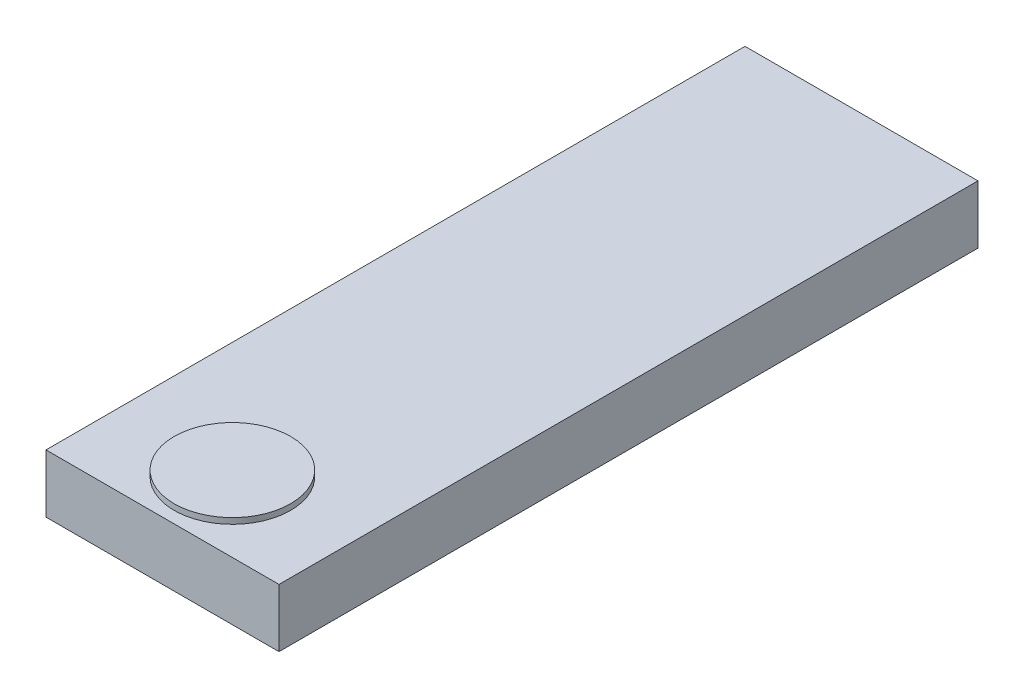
from build123d import *

# Parameters (mm, degrees)
SKETCH1_W           = 50.8
SKETCH1_H           = 12.7
BOSS_EXTRUDE1_DEPTH = 152.4
SKETCH2_R           = 12.7
BOSS_EXTRUDE2_DEPTH = 1.27


with BuildPart() as part:
    # Sketch1 → Boss-Extrude1 (new body)
    with BuildSketch(Plane.XY):
        with Locations((0, -6.35)):
            Rectangle(SKETCH1_W, SKETCH1_H)
    extrude(amount=BOSS_EXTRUDE1_DEPTH)

    # Sketch2 → Boss-Extrude2 (add)
    with BuildSketch(Plane(origin=(0, 0, 0), x_dir=(1, 0, 0), z_dir=(0, 1, 0))):
        with Locations(Location((0, -137.16, 0), (0, 0, 90))):
            Circle(SKETCH2_R)
    extrude(amount=BOSS_EXTRUDE2_DEPTH)


solid = part.part
